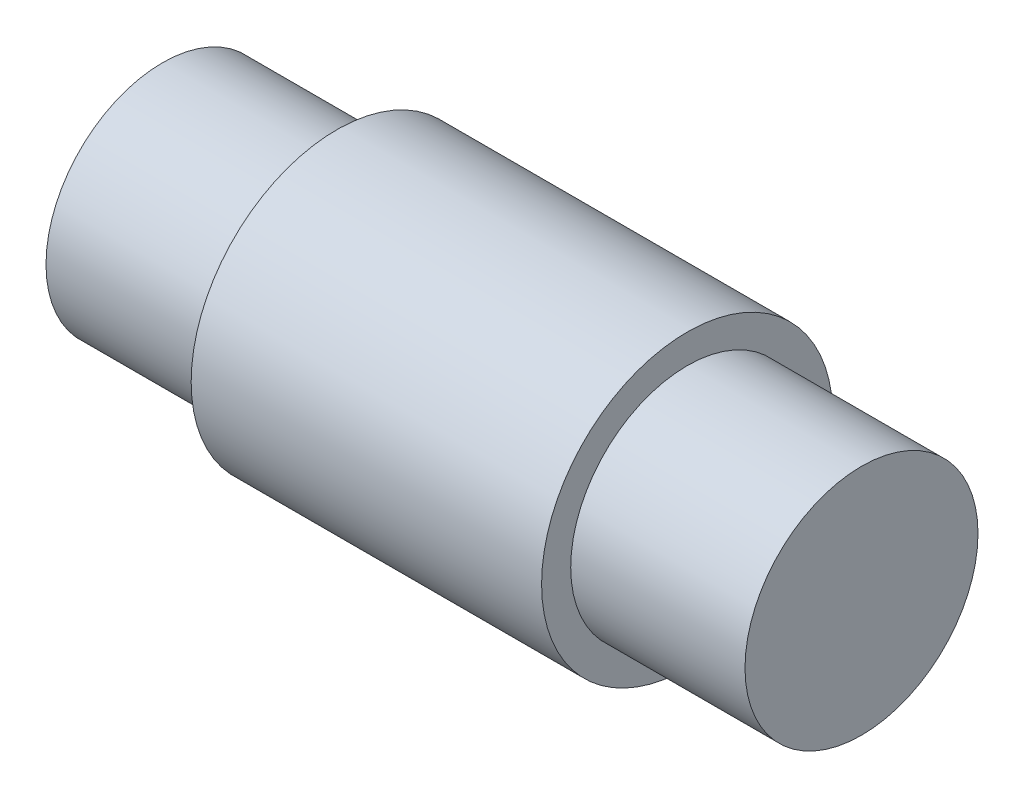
from build123d import *


with BuildPart() as part:
    # Sketch1 → Revolve1 (revolve)
    with BuildSketch(Plane.XY, mode=Mode.PRIVATE) as revolve1_sk:
        Polygon((-9.525, 0), (-9.525, 3.175), (-4.775, 3.175), (-4.775, 3.96875), (4.775, 3.96875), (4.775, 3.175), (9.525, 3.175), (9.525, 0), align=None)
    revolve(revolve1_sk.sketch.rotate(Axis((-76.456488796, 0, 0), (1, 0, 0)), 90), axis=Axis((-76.456488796, 0, 0), (1, 0, 0)))


solid = part.part
